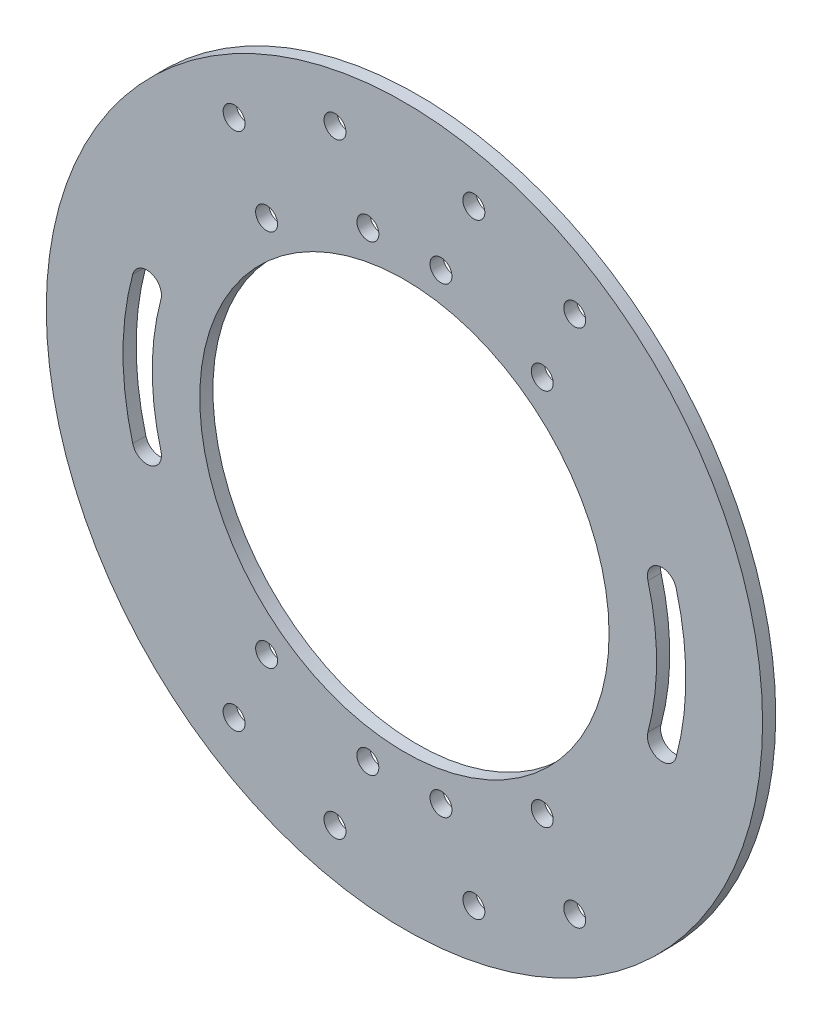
ISO-10303-21;
HEADER;
FILE_DESCRIPTION(('STEP AP214'),'2;1');
FILE_NAME('part.step','',(''),(''),'','','');
FILE_SCHEMA(('AUTOMOTIVE_DESIGN { 1 0 10303 214 1 1 1 1 }'));
ENDSEC;
DATA;
#1=APPLICATION_CONTEXT('core data for automotive mechanical design processes');
#2=APPLICATION_PROTOCOL_DEFINITION('international standard','automotive_design',2000,#1);
#3=PRODUCT_CONTEXT('',#1,'mechanical');
#4=PRODUCT('Part','Part','',(#3));
#5=PRODUCT_RELATED_PRODUCT_CATEGORY('part','',(#4));
#6=PRODUCT_DEFINITION_FORMATION('','',#4);
#7=PRODUCT_DEFINITION_CONTEXT('part definition',#1,'design');
#8=PRODUCT_DEFINITION('design','',#6,#7);
#9=PRODUCT_DEFINITION_SHAPE('','',#8);
#10=(LENGTH_UNIT() NAMED_UNIT(*) SI_UNIT(.MILLI.,.METRE.));
#11=(NAMED_UNIT(*) PLANE_ANGLE_UNIT() SI_UNIT($,.RADIAN.));
#12=(NAMED_UNIT(*) SI_UNIT($,.STERADIAN.) SOLID_ANGLE_UNIT());
#13=UNCERTAINTY_MEASURE_WITH_UNIT(LENGTH_MEASURE(1.E-05),#10,'distance_accuracy_value','');
#14=(GEOMETRIC_REPRESENTATION_CONTEXT(3) GLOBAL_UNCERTAINTY_ASSIGNED_CONTEXT((#13)) GLOBAL_UNIT_ASSIGNED_CONTEXT((#10,
#11,#12)) REPRESENTATION_CONTEXT('',''));
#15=CARTESIAN_POINT('',(0.,0.,0.));
#16=DIRECTION('',(0.,0.,1.));
#17=DIRECTION('',(1.,0.,0.));
#18=AXIS2_PLACEMENT_3D('',#15,#16,#17);
#19=CARTESIAN_POINT('',(0.,0.,1.8));
#20=DIRECTION('',(0.,0.,1.));
#21=DIRECTION('',(1.,0.,0.));
#22=AXIS2_PLACEMENT_3D('',#19,#20,#21);
#23=PLANE('',#22);
#24=CARTESIAN_POINT('',(35.2420203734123,9.49999999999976,1.8));
#25=DIRECTION('',(0.,0.,1.));
#26=DIRECTION('',(-1.,0.,0.));
#27=AXIS2_PLACEMENT_3D('',#24,#25,#26);
#28=CIRCLE('',#27,2.);
#29=CARTESIAN_POINT('',(37.1730899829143,10.0205479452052,1.8));
#30=VERTEX_POINT('',#29);
#31=CARTESIAN_POINT('',(33.3109507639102,8.97945205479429,1.8));
#32=VERTEX_POINT('',#31);
#33=EDGE_CURVE('E368',#30,#32,#28,.T.);
#34=ORIENTED_EDGE('',*,*,#33,.F.);
#35=CARTESIAN_POINT('',(0.,0.,1.8));
#36=DIRECTION('',(0.,0.,1.));
#37=DIRECTION('',(-1.,0.,0.));
#38=AXIS2_PLACEMENT_3D('',#35,#36,#37);
#39=CIRCLE('',#38,38.5);
#40=CARTESIAN_POINT('',(37.1730899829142,-10.0205479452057,1.8));
#41=VERTEX_POINT('',#40);
#42=EDGE_CURVE('E435',#41,#30,#39,.T.);
#43=ORIENTED_EDGE('',*,*,#42,.F.);
#44=CARTESIAN_POINT('',(35.2420203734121,-9.50000000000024,1.8));
#45=DIRECTION('',(0.,0.,1.));
#46=DIRECTION('',(-1.,0.,0.));
#47=AXIS2_PLACEMENT_3D('',#44,#45,#46);
#48=CIRCLE('',#47,2.);
#49=CARTESIAN_POINT('',(33.3109507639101,-8.97945205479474,1.8));
#50=VERTEX_POINT('',#49);
#51=EDGE_CURVE('E420',#50,#41,#48,.T.);
#52=ORIENTED_EDGE('',*,*,#51,.F.);
#53=CARTESIAN_POINT('',(0.,0.,1.8));
#54=DIRECTION('',(0.,0.,-1.));
#55=DIRECTION('',(-1.,0.,0.));
#56=AXIS2_PLACEMENT_3D('',#53,#54,#55);
#57=CIRCLE('',#56,34.5);
#58=EDGE_CURVE('E429',#32,#50,#57,.T.);
#59=ORIENTED_EDGE('',*,*,#58,.F.);
#60=EDGE_LOOP('',(#34,#43,#52,#59));
#61=FACE_BOUND('',#60,.T.);
#62=CARTESIAN_POINT('',(-35.2420203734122,-9.5,1.8));
#63=DIRECTION('',(0.,0.,1.));
#64=DIRECTION('',(1.,0.,0.));
#65=AXIS2_PLACEMENT_3D('',#62,#63,#64);
#66=CIRCLE('',#65,2.);
#67=CARTESIAN_POINT('',(-37.1730899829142,-10.0205479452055,1.8));
#68=VERTEX_POINT('',#67);
#69=CARTESIAN_POINT('',(-33.3109507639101,-8.97945205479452,1.8));
#70=VERTEX_POINT('',#69);
#71=EDGE_CURVE('E451',#68,#70,#66,.T.);
#72=ORIENTED_EDGE('',*,*,#71,.F.);
#73=CARTESIAN_POINT('',(0.,0.,1.8));
#74=DIRECTION('',(0.,0.,1.));
#75=DIRECTION('',(1.,0.,0.));
#76=AXIS2_PLACEMENT_3D('',#73,#74,#75);
#77=CIRCLE('',#76,38.5);
#78=CARTESIAN_POINT('',(-37.1730899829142,10.0205479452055,1.8));
#79=VERTEX_POINT('',#78);
#80=EDGE_CURVE('E461',#79,#68,#77,.T.);
#81=ORIENTED_EDGE('',*,*,#80,.F.);
#82=CARTESIAN_POINT('',(-35.2420203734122,9.5,1.8));
#83=DIRECTION('',(0.,0.,1.));
#84=DIRECTION('',(1.,0.,0.));
#85=AXIS2_PLACEMENT_3D('',#82,#83,#84);
#86=CIRCLE('',#85,2.);
#87=CARTESIAN_POINT('',(-33.3109507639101,8.97945205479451,1.8));
#88=VERTEX_POINT('',#87);
#89=EDGE_CURVE('E458',#88,#79,#86,.T.);
#90=ORIENTED_EDGE('',*,*,#89,.F.);
#91=CARTESIAN_POINT('',(0.,0.,1.8));
#92=DIRECTION('',(0.,0.,-1.));
#93=DIRECTION('',(1.,0.,0.));
#94=AXIS2_PLACEMENT_3D('',#91,#92,#93);
#95=CIRCLE('',#94,34.5);
#96=EDGE_CURVE('E455',#70,#88,#95,.T.);
#97=ORIENTED_EDGE('',*,*,#96,.F.);
#98=EDGE_LOOP('',(#72,#81,#90,#97));
#99=FACE_BOUND('',#98,.T.);
#100=CARTESIAN_POINT('',(-18.8537723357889,-25.8560489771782,1.8));
#101=DIRECTION('',(0.,0.,1.));
#102=DIRECTION('',(-1.,0.,0.));
#103=AXIS2_PLACEMENT_3D('',#100,#101,#102);
#104=CIRCLE('',#103,1.5);
#105=CARTESIAN_POINT('',(-20.3537723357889,-25.8560489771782,1.8));
#106=VERTEX_POINT('',#105);
#107=EDGE_CURVE('E494',#106,#106,#104,.T.);
#108=ORIENTED_EDGE('',*,*,#107,.F.);
#109=EDGE_LOOP('',(#108));
#110=FACE_BOUND('',#109,.T.);
#111=CARTESIAN_POINT('',(-23.2993075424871,-35.5442297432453,1.8));
#112=DIRECTION('',(0.,0.,1.));
#113=DIRECTION('',(-1.,0.,0.));
#114=AXIS2_PLACEMENT_3D('',#111,#112,#113);
#115=CIRCLE('',#114,1.5);
#116=CARTESIAN_POINT('',(-24.7993075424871,-35.5442297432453,1.8));
#117=VERTEX_POINT('',#116);
#118=EDGE_CURVE('E506',#117,#117,#115,.T.);
#119=ORIENTED_EDGE('',*,*,#118,.F.);
#120=EDGE_LOOP('',(#119));
#121=FACE_BOUND('',#120,.T.);
#122=CARTESIAN_POINT('',(9.50000000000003,-41.4246303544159,1.8));
#123=DIRECTION('',(0.,0.,1.));
#124=DIRECTION('',(1.,0.,0.));
#125=AXIS2_PLACEMENT_3D('',#122,#123,#124);
#126=CIRCLE('',#125,1.5);
#127=CARTESIAN_POINT('',(11.,-41.4246303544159,1.8));
#128=VERTEX_POINT('',#127);
#129=EDGE_CURVE('E518',#128,#128,#126,.T.);
#130=ORIENTED_EDGE('',*,*,#129,.F.);
#131=EDGE_LOOP('',(#130));
#132=FACE_BOUND('',#131,.T.);
#133=CARTESIAN_POINT('',(5.00000000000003,-31.6069612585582,1.8));
#134=DIRECTION('',(0.,0.,1.));
#135=DIRECTION('',(1.,0.,0.));
#136=AXIS2_PLACEMENT_3D('',#133,#134,#135);
#137=CIRCLE('',#136,1.49999999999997);
#138=CARTESIAN_POINT('',(6.50000000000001,-31.6069612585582,1.8));
#139=VERTEX_POINT('',#138);
#140=EDGE_CURVE('E530',#139,#139,#137,.T.);
#141=ORIENTED_EDGE('',*,*,#140,.F.);
#142=EDGE_LOOP('',(#141));
#143=FACE_BOUND('',#142,.T.);
#144=CARTESIAN_POINT('',(18.853772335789,25.8560489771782,1.8));
#145=DIRECTION('',(0.,0.,1.));
#146=DIRECTION('',(-1.,0.,0.));
#147=AXIS2_PLACEMENT_3D('',#144,#145,#146);
#148=CIRCLE('',#147,1.5);
#149=CARTESIAN_POINT('',(17.353772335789,25.8560489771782,1.8));
#150=VERTEX_POINT('',#149);
#151=EDGE_CURVE('E542',#150,#150,#148,.T.);
#152=ORIENTED_EDGE('',*,*,#151,.F.);
#153=EDGE_LOOP('',(#152));
#154=FACE_BOUND('',#153,.T.);
#155=CARTESIAN_POINT('',(23.2993075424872,35.5442297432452,1.8));
#156=DIRECTION('',(0.,0.,1.));
#157=DIRECTION('',(-1.,0.,0.));
#158=AXIS2_PLACEMENT_3D('',#155,#156,#157);
#159=CIRCLE('',#158,1.5);
#160=CARTESIAN_POINT('',(21.7993075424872,35.5442297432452,1.8));
#161=VERTEX_POINT('',#160);
#162=EDGE_CURVE('E554',#161,#161,#159,.T.);
#163=ORIENTED_EDGE('',*,*,#162,.F.);
#164=EDGE_LOOP('',(#163));
#165=FACE_BOUND('',#164,.T.);
#166=CARTESIAN_POINT('',(-9.50000000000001,41.424630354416,1.8));
#167=DIRECTION('',(0.,0.,1.));
#168=DIRECTION('',(1.,0.,0.));
#169=AXIS2_PLACEMENT_3D('',#166,#167,#168);
#170=CIRCLE('',#169,1.5);
#171=CARTESIAN_POINT('',(-8.,41.424630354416,1.8));
#172=VERTEX_POINT('',#171);
#173=EDGE_CURVE('E566',#172,#172,#170,.T.);
#174=ORIENTED_EDGE('',*,*,#173,.F.);
#175=EDGE_LOOP('',(#174));
#176=FACE_BOUND('',#175,.T.);
#177=CARTESIAN_POINT('',(-5.,31.6069612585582,1.8));
#178=DIRECTION('',(0.,0.,1.));
#179=DIRECTION('',(1.,0.,0.));
#180=AXIS2_PLACEMENT_3D('',#177,#178,#179);
#181=CIRCLE('',#180,1.5);
#182=CARTESIAN_POINT('',(-3.5,31.6069612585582,1.8));
#183=VERTEX_POINT('',#182);
#184=EDGE_CURVE('E578',#183,#183,#181,.T.);
#185=ORIENTED_EDGE('',*,*,#184,.F.);
#186=EDGE_LOOP('',(#185));
#187=FACE_BOUND('',#186,.T.);
#188=CARTESIAN_POINT('',(0.,0.,1.8));
#189=DIRECTION('',(0.,0.,1.));
#190=DIRECTION('',(1.,0.,0.));
#191=AXIS2_PLACEMENT_3D('',#188,#189,#190);
#192=CIRCLE('',#191,49.);
#193=CARTESIAN_POINT('',(49.,0.,1.8));
#194=VERTEX_POINT('',#193);
#195=EDGE_CURVE('E11',#194,#194,#192,.T.);
#196=ORIENTED_EDGE('',*,*,#195,.T.);
#197=EDGE_LOOP('',(#196));
#198=FACE_BOUND('',#197,.T.);
#199=CARTESIAN_POINT('',(0.,0.,1.8));
#200=DIRECTION('',(0.,0.,1.));
#201=DIRECTION('',(1.,0.,0.));
#202=AXIS2_PLACEMENT_3D('',#199,#200,#201);
#203=CIRCLE('',#202,28.);
#204=CARTESIAN_POINT('',(28.,0.,1.8));
#205=VERTEX_POINT('',#204);
#206=EDGE_CURVE('E584',#205,#205,#203,.T.);
#207=ORIENTED_EDGE('',*,*,#206,.F.);
#208=EDGE_LOOP('',(#207));
#209=FACE_BOUND('',#208,.T.);
#210=CARTESIAN_POINT('',(-18.853772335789,25.8560489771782,1.8));
#211=DIRECTION('',(0.,0.,1.));
#212=DIRECTION('',(1.,0.,0.));
#213=AXIS2_PLACEMENT_3D('',#210,#211,#212);
#214=CIRCLE('',#213,1.5);
#215=CARTESIAN_POINT('',(-17.353772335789,25.8560489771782,1.8));
#216=VERTEX_POINT('',#215);
#217=EDGE_CURVE('E572',#216,#216,#214,.T.);
#218=ORIENTED_EDGE('',*,*,#217,.F.);
#219=EDGE_LOOP('',(#218));
#220=FACE_BOUND('',#219,.T.);
#221=CARTESIAN_POINT('',(-23.2993075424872,35.5442297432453,1.8));
#222=DIRECTION('',(0.,0.,1.));
#223=DIRECTION('',(1.,0.,0.));
#224=AXIS2_PLACEMENT_3D('',#221,#222,#223);
#225=CIRCLE('',#224,1.5);
#226=CARTESIAN_POINT('',(-21.7993075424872,35.5442297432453,1.8));
#227=VERTEX_POINT('',#226);
#228=EDGE_CURVE('E560',#227,#227,#225,.T.);
#229=ORIENTED_EDGE('',*,*,#228,.F.);
#230=EDGE_LOOP('',(#229));
#231=FACE_BOUND('',#230,.T.);
#232=CARTESIAN_POINT('',(9.50000000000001,41.4246303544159,1.8));
#233=DIRECTION('',(0.,0.,1.));
#234=DIRECTION('',(-1.,0.,0.));
#235=AXIS2_PLACEMENT_3D('',#232,#233,#234);
#236=CIRCLE('',#235,1.5);
#237=CARTESIAN_POINT('',(8.,41.4246303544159,1.8));
#238=VERTEX_POINT('',#237);
#239=EDGE_CURVE('E548',#238,#238,#236,.T.);
#240=ORIENTED_EDGE('',*,*,#239,.F.);
#241=EDGE_LOOP('',(#240));
#242=FACE_BOUND('',#241,.T.);
#243=CARTESIAN_POINT('',(5.,31.6069612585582,1.8));
#244=DIRECTION('',(0.,0.,1.));
#245=DIRECTION('',(-1.,0.,0.));
#246=AXIS2_PLACEMENT_3D('',#243,#244,#245);
#247=CIRCLE('',#246,1.5);
#248=CARTESIAN_POINT('',(3.5,31.6069612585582,1.8));
#249=VERTEX_POINT('',#248);
#250=EDGE_CURVE('E536',#249,#249,#247,.T.);
#251=ORIENTED_EDGE('',*,*,#250,.F.);
#252=EDGE_LOOP('',(#251));
#253=FACE_BOUND('',#252,.T.);
#254=CARTESIAN_POINT('',(18.853772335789,-25.8560489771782,1.8));
#255=DIRECTION('',(0.,0.,1.));
#256=DIRECTION('',(1.,0.,0.));
#257=AXIS2_PLACEMENT_3D('',#254,#255,#256);
#258=CIRCLE('',#257,1.5);
#259=CARTESIAN_POINT('',(20.353772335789,-25.8560489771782,1.8));
#260=VERTEX_POINT('',#259);
#261=EDGE_CURVE('E524',#260,#260,#258,.T.);
#262=ORIENTED_EDGE('',*,*,#261,.F.);
#263=EDGE_LOOP('',(#262));
#264=FACE_BOUND('',#263,.T.);
#265=CARTESIAN_POINT('',(23.2993075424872,-35.5442297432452,1.8));
#266=DIRECTION('',(0.,0.,1.));
#267=DIRECTION('',(1.,0.,0.));
#268=AXIS2_PLACEMENT_3D('',#265,#266,#267);
#269=CIRCLE('',#268,1.5);
#270=CARTESIAN_POINT('',(24.7993075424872,-35.5442297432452,1.8));
#271=VERTEX_POINT('',#270);
#272=EDGE_CURVE('E512',#271,#271,#269,.T.);
#273=ORIENTED_EDGE('',*,*,#272,.F.);
#274=EDGE_LOOP('',(#273));
#275=FACE_BOUND('',#274,.T.);
#276=CARTESIAN_POINT('',(-9.49999999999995,-41.424630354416,1.8));
#277=DIRECTION('',(0.,0.,1.));
#278=DIRECTION('',(-1.,0.,0.));
#279=AXIS2_PLACEMENT_3D('',#276,#277,#278);
#280=CIRCLE('',#279,1.5);
#281=CARTESIAN_POINT('',(-11.,-41.424630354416,1.8));
#282=VERTEX_POINT('',#281);
#283=EDGE_CURVE('E500',#282,#282,#280,.T.);
#284=ORIENTED_EDGE('',*,*,#283,.F.);
#285=EDGE_LOOP('',(#284));
#286=FACE_BOUND('',#285,.T.);
#287=CARTESIAN_POINT('',(-4.99999999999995,-31.6069612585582,1.8));
#288=DIRECTION('',(0.,0.,1.));
#289=DIRECTION('',(-1.,0.,0.));
#290=AXIS2_PLACEMENT_3D('',#287,#288,#289);
#291=CIRCLE('',#290,1.5);
#292=CARTESIAN_POINT('',(-6.49999999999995,-31.6069612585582,1.8));
#293=VERTEX_POINT('',#292);
#294=EDGE_CURVE('E488',#293,#293,#291,.T.);
#295=ORIENTED_EDGE('',*,*,#294,.F.);
#296=EDGE_LOOP('',(#295));
#297=FACE_BOUND('',#296,.T.);
#298=ADVANCED_FACE('F353',(#61,#99,#110,#121,#132,#143,#154,#165,#176,#187,#198,#209,#220,#231,
#242,#253,#264,#275,#286,#297),#23,.T.);
#299=CARTESIAN_POINT('',(0.,0.,0.));
#300=DIRECTION('',(0.,0.,1.));
#301=DIRECTION('',(1.,0.,0.));
#302=AXIS2_PLACEMENT_3D('',#299,#300,#301);
#303=PLANE('',#302);
#304=CARTESIAN_POINT('',(0.,0.,0.));
#305=DIRECTION('',(0.,0.,1.));
#306=DIRECTION('',(-1.,0.,0.));
#307=AXIS2_PLACEMENT_3D('',#304,#305,#306);
#308=CIRCLE('',#307,38.5);
#309=CARTESIAN_POINT('',(37.1730899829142,-10.0205479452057,0.));
#310=VERTEX_POINT('',#309);
#311=CARTESIAN_POINT('',(37.1730899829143,10.0205479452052,0.));
#312=VERTEX_POINT('',#311);
#313=EDGE_CURVE('E446',#310,#312,#308,.T.);
#314=ORIENTED_EDGE('',*,*,#313,.T.);
#315=CARTESIAN_POINT('',(35.2420203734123,9.49999999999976,0.));
#316=DIRECTION('',(0.,0.,1.));
#317=DIRECTION('',(-1.,0.,0.));
#318=AXIS2_PLACEMENT_3D('',#315,#316,#317);
#319=CIRCLE('',#318,2.);
#320=CARTESIAN_POINT('',(33.3109507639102,8.97945205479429,0.));
#321=VERTEX_POINT('',#320);
#322=EDGE_CURVE('E437',#312,#321,#319,.T.);
#323=ORIENTED_EDGE('',*,*,#322,.T.);
#324=CARTESIAN_POINT('',(0.,0.,0.));
#325=DIRECTION('',(0.,0.,-1.));
#326=DIRECTION('',(-1.,0.,0.));
#327=AXIS2_PLACEMENT_3D('',#324,#325,#326);
#328=CIRCLE('',#327,34.5);
#329=CARTESIAN_POINT('',(33.3109507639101,-8.97945205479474,0.));
#330=VERTEX_POINT('',#329);
#331=EDGE_CURVE('E443',#321,#330,#328,.T.);
#332=ORIENTED_EDGE('',*,*,#331,.T.);
#333=CARTESIAN_POINT('',(35.2420203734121,-9.50000000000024,0.));
#334=DIRECTION('',(0.,0.,1.));
#335=DIRECTION('',(-1.,0.,0.));
#336=AXIS2_PLACEMENT_3D('',#333,#334,#335);
#337=CIRCLE('',#336,2.);
#338=EDGE_CURVE('E376',#330,#310,#337,.T.);
#339=ORIENTED_EDGE('',*,*,#338,.T.);
#340=EDGE_LOOP('',(#314,#323,#332,#339));
#341=FACE_BOUND('',#340,.T.);
#342=CARTESIAN_POINT('',(0.,0.,0.));
#343=DIRECTION('',(0.,0.,1.));
#344=DIRECTION('',(1.,0.,0.));
#345=AXIS2_PLACEMENT_3D('',#342,#343,#344);
#346=CIRCLE('',#345,38.5);
#347=CARTESIAN_POINT('',(-37.1730899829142,10.0205479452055,0.));
#348=VERTEX_POINT('',#347);
#349=CARTESIAN_POINT('',(-37.1730899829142,-10.0205479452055,0.));
#350=VERTEX_POINT('',#349);
#351=EDGE_CURVE('E473',#348,#350,#346,.T.);
#352=ORIENTED_EDGE('',*,*,#351,.T.);
#353=CARTESIAN_POINT('',(-35.2420203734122,-9.5,0.));
#354=DIRECTION('',(0.,0.,1.));
#355=DIRECTION('',(1.,0.,0.));
#356=AXIS2_PLACEMENT_3D('',#353,#354,#355);
#357=CIRCLE('',#356,2.);
#358=CARTESIAN_POINT('',(-33.3109507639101,-8.97945205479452,0.));
#359=VERTEX_POINT('',#358);
#360=EDGE_CURVE('E464',#350,#359,#357,.T.);
#361=ORIENTED_EDGE('',*,*,#360,.T.);
#362=CARTESIAN_POINT('',(0.,0.,0.));
#363=DIRECTION('',(0.,0.,-1.));
#364=DIRECTION('',(1.,0.,0.));
#365=AXIS2_PLACEMENT_3D('',#362,#363,#364);
#366=CIRCLE('',#365,34.5);
#367=CARTESIAN_POINT('',(-33.3109507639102,8.97945205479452,0.));
#368=VERTEX_POINT('',#367);
#369=EDGE_CURVE('E467',#359,#368,#366,.T.);
#370=ORIENTED_EDGE('',*,*,#369,.T.);
#371=CARTESIAN_POINT('',(-35.2420203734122,9.5,0.));
#372=DIRECTION('',(0.,0.,1.));
#373=DIRECTION('',(1.,0.,0.));
#374=AXIS2_PLACEMENT_3D('',#371,#372,#373);
#375=CIRCLE('',#374,2.);
#376=EDGE_CURVE('E470',#368,#348,#375,.T.);
#377=ORIENTED_EDGE('',*,*,#376,.T.);
#378=EDGE_LOOP('',(#352,#361,#370,#377));
#379=FACE_BOUND('',#378,.T.);
#380=CARTESIAN_POINT('',(-18.8537723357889,-25.8560489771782,0.));
#381=DIRECTION('',(0.,0.,1.));
#382=DIRECTION('',(-1.,0.,0.));
#383=AXIS2_PLACEMENT_3D('',#380,#381,#382);
#384=CIRCLE('',#383,1.5);
#385=CARTESIAN_POINT('',(-20.3537723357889,-25.8560489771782,0.));
#386=VERTEX_POINT('',#385);
#387=EDGE_CURVE('E491',#386,#386,#384,.T.);
#388=ORIENTED_EDGE('',*,*,#387,.T.);
#389=EDGE_LOOP('',(#388));
#390=FACE_BOUND('',#389,.T.);
#391=CARTESIAN_POINT('',(-23.2993075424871,-35.5442297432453,0.));
#392=DIRECTION('',(0.,0.,1.));
#393=DIRECTION('',(-1.,0.,0.));
#394=AXIS2_PLACEMENT_3D('',#391,#392,#393);
#395=CIRCLE('',#394,1.5);
#396=CARTESIAN_POINT('',(-24.7993075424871,-35.5442297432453,0.));
#397=VERTEX_POINT('',#396);
#398=EDGE_CURVE('E503',#397,#397,#395,.T.);
#399=ORIENTED_EDGE('',*,*,#398,.T.);
#400=EDGE_LOOP('',(#399));
#401=FACE_BOUND('',#400,.T.);
#402=CARTESIAN_POINT('',(9.50000000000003,-41.4246303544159,0.));
#403=DIRECTION('',(0.,0.,1.));
#404=DIRECTION('',(1.,0.,0.));
#405=AXIS2_PLACEMENT_3D('',#402,#403,#404);
#406=CIRCLE('',#405,1.5);
#407=CARTESIAN_POINT('',(11.,-41.4246303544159,0.));
#408=VERTEX_POINT('',#407);
#409=EDGE_CURVE('E515',#408,#408,#406,.T.);
#410=ORIENTED_EDGE('',*,*,#409,.T.);
#411=EDGE_LOOP('',(#410));
#412=FACE_BOUND('',#411,.T.);
#413=CARTESIAN_POINT('',(5.00000000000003,-31.6069612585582,0.));
#414=DIRECTION('',(0.,0.,1.));
#415=DIRECTION('',(1.,0.,0.));
#416=AXIS2_PLACEMENT_3D('',#413,#414,#415);
#417=CIRCLE('',#416,1.49999999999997);
#418=CARTESIAN_POINT('',(6.50000000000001,-31.6069612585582,0.));
#419=VERTEX_POINT('',#418);
#420=EDGE_CURVE('E527',#419,#419,#417,.T.);
#421=ORIENTED_EDGE('',*,*,#420,.T.);
#422=EDGE_LOOP('',(#421));
#423=FACE_BOUND('',#422,.T.);
#424=CARTESIAN_POINT('',(18.853772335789,25.8560489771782,0.));
#425=DIRECTION('',(0.,0.,1.));
#426=DIRECTION('',(-1.,0.,0.));
#427=AXIS2_PLACEMENT_3D('',#424,#425,#426);
#428=CIRCLE('',#427,1.5);
#429=CARTESIAN_POINT('',(17.353772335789,25.8560489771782,0.));
#430=VERTEX_POINT('',#429);
#431=EDGE_CURVE('E539',#430,#430,#428,.T.);
#432=ORIENTED_EDGE('',*,*,#431,.T.);
#433=EDGE_LOOP('',(#432));
#434=FACE_BOUND('',#433,.T.);
#435=CARTESIAN_POINT('',(23.2993075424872,35.5442297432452,0.));
#436=DIRECTION('',(0.,0.,1.));
#437=DIRECTION('',(-1.,0.,0.));
#438=AXIS2_PLACEMENT_3D('',#435,#436,#437);
#439=CIRCLE('',#438,1.5);
#440=CARTESIAN_POINT('',(21.7993075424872,35.5442297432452,0.));
#441=VERTEX_POINT('',#440);
#442=EDGE_CURVE('E551',#441,#441,#439,.T.);
#443=ORIENTED_EDGE('',*,*,#442,.T.);
#444=EDGE_LOOP('',(#443));
#445=FACE_BOUND('',#444,.T.);
#446=CARTESIAN_POINT('',(-9.50000000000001,41.424630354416,0.));
#447=DIRECTION('',(0.,0.,1.));
#448=DIRECTION('',(1.,0.,0.));
#449=AXIS2_PLACEMENT_3D('',#446,#447,#448);
#450=CIRCLE('',#449,1.5);
#451=CARTESIAN_POINT('',(-8.,41.424630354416,0.));
#452=VERTEX_POINT('',#451);
#453=EDGE_CURVE('E563',#452,#452,#450,.T.);
#454=ORIENTED_EDGE('',*,*,#453,.T.);
#455=EDGE_LOOP('',(#454));
#456=FACE_BOUND('',#455,.T.);
#457=CARTESIAN_POINT('',(-5.,31.6069612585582,0.));
#458=DIRECTION('',(0.,0.,1.));
#459=DIRECTION('',(1.,0.,0.));
#460=AXIS2_PLACEMENT_3D('',#457,#458,#459);
#461=CIRCLE('',#460,1.5);
#462=CARTESIAN_POINT('',(-3.5,31.6069612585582,0.));
#463=VERTEX_POINT('',#462);
#464=EDGE_CURVE('E575',#463,#463,#461,.T.);
#465=ORIENTED_EDGE('',*,*,#464,.T.);
#466=EDGE_LOOP('',(#465));
#467=FACE_BOUND('',#466,.T.);
#468=CARTESIAN_POINT('',(0.,0.,0.));
#469=DIRECTION('',(0.,0.,1.));
#470=DIRECTION('',(1.,0.,0.));
#471=AXIS2_PLACEMENT_3D('',#468,#469,#470);
#472=CIRCLE('',#471,49.);
#473=CARTESIAN_POINT('',(49.,0.,0.));
#474=VERTEX_POINT('',#473);
#475=EDGE_CURVE('E361',#474,#474,#472,.T.);
#476=ORIENTED_EDGE('',*,*,#475,.F.);
#477=EDGE_LOOP('',(#476));
#478=FACE_BOUND('',#477,.T.);
#479=CARTESIAN_POINT('',(0.,0.,0.));
#480=DIRECTION('',(0.,0.,1.));
#481=DIRECTION('',(1.,0.,0.));
#482=AXIS2_PLACEMENT_3D('',#479,#480,#481);
#483=CIRCLE('',#482,28.);
#484=CARTESIAN_POINT('',(28.,0.,0.));
#485=VERTEX_POINT('',#484);
#486=EDGE_CURVE('E581',#485,#485,#483,.T.);
#487=ORIENTED_EDGE('',*,*,#486,.T.);
#488=EDGE_LOOP('',(#487));
#489=FACE_BOUND('',#488,.T.);
#490=CARTESIAN_POINT('',(-18.853772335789,25.8560489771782,0.));
#491=DIRECTION('',(0.,0.,1.));
#492=DIRECTION('',(1.,0.,0.));
#493=AXIS2_PLACEMENT_3D('',#490,#491,#492);
#494=CIRCLE('',#493,1.5);
#495=CARTESIAN_POINT('',(-17.353772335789,25.8560489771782,0.));
#496=VERTEX_POINT('',#495);
#497=EDGE_CURVE('E569',#496,#496,#494,.T.);
#498=ORIENTED_EDGE('',*,*,#497,.T.);
#499=EDGE_LOOP('',(#498));
#500=FACE_BOUND('',#499,.T.);
#501=CARTESIAN_POINT('',(-23.2993075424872,35.5442297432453,0.));
#502=DIRECTION('',(0.,0.,1.));
#503=DIRECTION('',(1.,0.,0.));
#504=AXIS2_PLACEMENT_3D('',#501,#502,#503);
#505=CIRCLE('',#504,1.5);
#506=CARTESIAN_POINT('',(-21.7993075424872,35.5442297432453,0.));
#507=VERTEX_POINT('',#506);
#508=EDGE_CURVE('E557',#507,#507,#505,.T.);
#509=ORIENTED_EDGE('',*,*,#508,.T.);
#510=EDGE_LOOP('',(#509));
#511=FACE_BOUND('',#510,.T.);
#512=CARTESIAN_POINT('',(9.50000000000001,41.4246303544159,0.));
#513=DIRECTION('',(0.,0.,1.));
#514=DIRECTION('',(-1.,0.,0.));
#515=AXIS2_PLACEMENT_3D('',#512,#513,#514);
#516=CIRCLE('',#515,1.5);
#517=CARTESIAN_POINT('',(8.,41.4246303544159,0.));
#518=VERTEX_POINT('',#517);
#519=EDGE_CURVE('E545',#518,#518,#516,.T.);
#520=ORIENTED_EDGE('',*,*,#519,.T.);
#521=EDGE_LOOP('',(#520));
#522=FACE_BOUND('',#521,.T.);
#523=CARTESIAN_POINT('',(5.,31.6069612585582,0.));
#524=DIRECTION('',(0.,0.,1.));
#525=DIRECTION('',(-1.,0.,0.));
#526=AXIS2_PLACEMENT_3D('',#523,#524,#525);
#527=CIRCLE('',#526,1.5);
#528=CARTESIAN_POINT('',(3.5,31.6069612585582,0.));
#529=VERTEX_POINT('',#528);
#530=EDGE_CURVE('E533',#529,#529,#527,.T.);
#531=ORIENTED_EDGE('',*,*,#530,.T.);
#532=EDGE_LOOP('',(#531));
#533=FACE_BOUND('',#532,.T.);
#534=CARTESIAN_POINT('',(18.853772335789,-25.8560489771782,0.));
#535=DIRECTION('',(0.,0.,1.));
#536=DIRECTION('',(1.,0.,0.));
#537=AXIS2_PLACEMENT_3D('',#534,#535,#536);
#538=CIRCLE('',#537,1.5);
#539=CARTESIAN_POINT('',(20.353772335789,-25.8560489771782,0.));
#540=VERTEX_POINT('',#539);
#541=EDGE_CURVE('E521',#540,#540,#538,.T.);
#542=ORIENTED_EDGE('',*,*,#541,.T.);
#543=EDGE_LOOP('',(#542));
#544=FACE_BOUND('',#543,.T.);
#545=CARTESIAN_POINT('',(23.2993075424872,-35.5442297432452,0.));
#546=DIRECTION('',(0.,0.,1.));
#547=DIRECTION('',(1.,0.,0.));
#548=AXIS2_PLACEMENT_3D('',#545,#546,#547);
#549=CIRCLE('',#548,1.5);
#550=CARTESIAN_POINT('',(24.7993075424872,-35.5442297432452,0.));
#551=VERTEX_POINT('',#550);
#552=EDGE_CURVE('E509',#551,#551,#549,.T.);
#553=ORIENTED_EDGE('',*,*,#552,.T.);
#554=EDGE_LOOP('',(#553));
#555=FACE_BOUND('',#554,.T.);
#556=CARTESIAN_POINT('',(-9.49999999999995,-41.424630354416,0.));
#557=DIRECTION('',(0.,0.,1.));
#558=DIRECTION('',(-1.,0.,0.));
#559=AXIS2_PLACEMENT_3D('',#556,#557,#558);
#560=CIRCLE('',#559,1.5);
#561=CARTESIAN_POINT('',(-11.,-41.424630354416,0.));
#562=VERTEX_POINT('',#561);
#563=EDGE_CURVE('E497',#562,#562,#560,.T.);
#564=ORIENTED_EDGE('',*,*,#563,.T.);
#565=EDGE_LOOP('',(#564));
#566=FACE_BOUND('',#565,.T.);
#567=CARTESIAN_POINT('',(-4.99999999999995,-31.6069612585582,0.));
#568=DIRECTION('',(0.,0.,1.));
#569=DIRECTION('',(-1.,0.,0.));
#570=AXIS2_PLACEMENT_3D('',#567,#568,#569);
#571=CIRCLE('',#570,1.5);
#572=CARTESIAN_POINT('',(-6.49999999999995,-31.6069612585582,0.));
#573=VERTEX_POINT('',#572);
#574=EDGE_CURVE('E479',#573,#573,#571,.T.);
#575=ORIENTED_EDGE('',*,*,#574,.T.);
#576=EDGE_LOOP('',(#575));
#577=FACE_BOUND('',#576,.T.);
#578=ADVANCED_FACE('F590',(#341,#379,#390,#401,#412,#423,#434,#445,#456,#467,#478,#489,#500,
#511,#522,#533,#544,#555,#566,#577),#303,.F.);
#579=CARTESIAN_POINT('',(0.,0.,1.8));
#580=DIRECTION('',(0.,0.,-1.));
#581=DIRECTION('',(-1.,0.,0.));
#582=AXIS2_PLACEMENT_3D('',#579,#580,#581);
#583=CYLINDRICAL_SURFACE('',#582,49.);
#584=ORIENTED_EDGE('',*,*,#195,.F.);
#585=EDGE_LOOP('',(#584));
#586=FACE_BOUND('',#585,.T.);
#587=ORIENTED_EDGE('',*,*,#475,.T.);
#588=EDGE_LOOP('',(#587));
#589=FACE_BOUND('',#588,.T.);
#590=ADVANCED_FACE('F355',(#586,#589),#583,.T.);
#591=CARTESIAN_POINT('',(0.,0.,1.8));
#592=DIRECTION('',(0.,0.,-1.));
#593=DIRECTION('',(-1.,0.,0.));
#594=AXIS2_PLACEMENT_3D('',#591,#592,#593);
#595=CYLINDRICAL_SURFACE('',#594,28.);
#596=ORIENTED_EDGE('',*,*,#206,.T.);
#597=EDGE_LOOP('',(#596));
#598=FACE_BOUND('',#597,.T.);
#599=ORIENTED_EDGE('',*,*,#486,.F.);
#600=EDGE_LOOP('',(#599));
#601=FACE_BOUND('',#600,.T.);
#602=ADVANCED_FACE('F634',(#598,#601),#595,.F.);
#603=CARTESIAN_POINT('',(-5.,31.6069612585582,1.8));
#604=DIRECTION('',(0.,0.,-1.));
#605=DIRECTION('',(-1.,0.,0.));
#606=AXIS2_PLACEMENT_3D('',#603,#604,#605);
#607=CYLINDRICAL_SURFACE('',#606,1.5);
#608=ORIENTED_EDGE('',*,*,#184,.T.);
#609=EDGE_LOOP('',(#608));
#610=FACE_BOUND('',#609,.T.);
#611=ORIENTED_EDGE('',*,*,#464,.F.);
#612=EDGE_LOOP('',(#611));
#613=FACE_BOUND('',#612,.T.);
#614=ADVANCED_FACE('F637',(#610,#613),#607,.F.);
#615=CARTESIAN_POINT('',(-18.853772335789,25.8560489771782,1.8));
#616=DIRECTION('',(0.,0.,-1.));
#617=DIRECTION('',(-1.,0.,0.));
#618=AXIS2_PLACEMENT_3D('',#615,#616,#617);
#619=CYLINDRICAL_SURFACE('',#618,1.5);
#620=ORIENTED_EDGE('',*,*,#217,.T.);
#621=EDGE_LOOP('',(#620));
#622=FACE_BOUND('',#621,.T.);
#623=ORIENTED_EDGE('',*,*,#497,.F.);
#624=EDGE_LOOP('',(#623));
#625=FACE_BOUND('',#624,.T.);
#626=ADVANCED_FACE('F641',(#622,#625),#619,.F.);
#627=CARTESIAN_POINT('',(-9.50000000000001,41.424630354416,1.8));
#628=DIRECTION('',(0.,0.,-1.));
#629=DIRECTION('',(-1.,0.,0.));
#630=AXIS2_PLACEMENT_3D('',#627,#628,#629);
#631=CYLINDRICAL_SURFACE('',#630,1.5);
#632=ORIENTED_EDGE('',*,*,#173,.T.);
#633=EDGE_LOOP('',(#632));
#634=FACE_BOUND('',#633,.T.);
#635=ORIENTED_EDGE('',*,*,#453,.F.);
#636=EDGE_LOOP('',(#635));
#637=FACE_BOUND('',#636,.T.);
#638=ADVANCED_FACE('F645',(#634,#637),#631,.F.);
#639=CARTESIAN_POINT('',(-23.2993075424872,35.5442297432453,1.8));
#640=DIRECTION('',(0.,0.,-1.));
#641=DIRECTION('',(-1.,0.,0.));
#642=AXIS2_PLACEMENT_3D('',#639,#640,#641);
#643=CYLINDRICAL_SURFACE('',#642,1.5);
#644=ORIENTED_EDGE('',*,*,#228,.T.);
#645=EDGE_LOOP('',(#644));
#646=FACE_BOUND('',#645,.T.);
#647=ORIENTED_EDGE('',*,*,#508,.F.);
#648=EDGE_LOOP('',(#647));
#649=FACE_BOUND('',#648,.T.);
#650=ADVANCED_FACE('F649',(#646,#649),#643,.F.);
#651=CARTESIAN_POINT('',(23.2993075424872,35.5442297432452,1.8));
#652=DIRECTION('',(0.,0.,-1.));
#653=DIRECTION('',(-1.,0.,0.));
#654=AXIS2_PLACEMENT_3D('',#651,#652,#653);
#655=CYLINDRICAL_SURFACE('',#654,1.5);
#656=ORIENTED_EDGE('',*,*,#162,.T.);
#657=EDGE_LOOP('',(#656));
#658=FACE_BOUND('',#657,.T.);
#659=ORIENTED_EDGE('',*,*,#442,.F.);
#660=EDGE_LOOP('',(#659));
#661=FACE_BOUND('',#660,.T.);
#662=ADVANCED_FACE('F653',(#658,#661),#655,.F.);
#663=CARTESIAN_POINT('',(9.50000000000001,41.4246303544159,1.8));
#664=DIRECTION('',(0.,0.,-1.));
#665=DIRECTION('',(-1.,0.,0.));
#666=AXIS2_PLACEMENT_3D('',#663,#664,#665);
#667=CYLINDRICAL_SURFACE('',#666,1.5);
#668=ORIENTED_EDGE('',*,*,#239,.T.);
#669=EDGE_LOOP('',(#668));
#670=FACE_BOUND('',#669,.T.);
#671=ORIENTED_EDGE('',*,*,#519,.F.);
#672=EDGE_LOOP('',(#671));
#673=FACE_BOUND('',#672,.T.);
#674=ADVANCED_FACE('F657',(#670,#673),#667,.F.);
#675=CARTESIAN_POINT('',(18.853772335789,25.8560489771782,1.8));
#676=DIRECTION('',(0.,0.,-1.));
#677=DIRECTION('',(-1.,0.,0.));
#678=AXIS2_PLACEMENT_3D('',#675,#676,#677);
#679=CYLINDRICAL_SURFACE('',#678,1.5);
#680=ORIENTED_EDGE('',*,*,#151,.T.);
#681=EDGE_LOOP('',(#680));
#682=FACE_BOUND('',#681,.T.);
#683=ORIENTED_EDGE('',*,*,#431,.F.);
#684=EDGE_LOOP('',(#683));
#685=FACE_BOUND('',#684,.T.);
#686=ADVANCED_FACE('F661',(#682,#685),#679,.F.);
#687=CARTESIAN_POINT('',(5.,31.6069612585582,1.8));
#688=DIRECTION('',(0.,0.,-1.));
#689=DIRECTION('',(-1.,0.,0.));
#690=AXIS2_PLACEMENT_3D('',#687,#688,#689);
#691=CYLINDRICAL_SURFACE('',#690,1.5);
#692=ORIENTED_EDGE('',*,*,#250,.T.);
#693=EDGE_LOOP('',(#692));
#694=FACE_BOUND('',#693,.T.);
#695=ORIENTED_EDGE('',*,*,#530,.F.);
#696=EDGE_LOOP('',(#695));
#697=FACE_BOUND('',#696,.T.);
#698=ADVANCED_FACE('F665',(#694,#697),#691,.F.);
#699=CARTESIAN_POINT('',(5.00000000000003,-31.6069612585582,1.8));
#700=DIRECTION('',(0.,0.,-1.));
#701=DIRECTION('',(-1.,0.,0.));
#702=AXIS2_PLACEMENT_3D('',#699,#700,#701);
#703=CYLINDRICAL_SURFACE('',#702,1.49999999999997);
#704=ORIENTED_EDGE('',*,*,#140,.T.);
#705=EDGE_LOOP('',(#704));
#706=FACE_BOUND('',#705,.T.);
#707=ORIENTED_EDGE('',*,*,#420,.F.);
#708=EDGE_LOOP('',(#707));
#709=FACE_BOUND('',#708,.T.);
#710=ADVANCED_FACE('F669',(#706,#709),#703,.F.);
#711=CARTESIAN_POINT('',(18.853772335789,-25.8560489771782,1.8));
#712=DIRECTION('',(0.,0.,-1.));
#713=DIRECTION('',(-1.,0.,0.));
#714=AXIS2_PLACEMENT_3D('',#711,#712,#713);
#715=CYLINDRICAL_SURFACE('',#714,1.5);
#716=ORIENTED_EDGE('',*,*,#261,.T.);
#717=EDGE_LOOP('',(#716));
#718=FACE_BOUND('',#717,.T.);
#719=ORIENTED_EDGE('',*,*,#541,.F.);
#720=EDGE_LOOP('',(#719));
#721=FACE_BOUND('',#720,.T.);
#722=ADVANCED_FACE('F673',(#718,#721),#715,.F.);
#723=CARTESIAN_POINT('',(9.50000000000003,-41.4246303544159,1.8));
#724=DIRECTION('',(0.,0.,-1.));
#725=DIRECTION('',(-1.,0.,0.));
#726=AXIS2_PLACEMENT_3D('',#723,#724,#725);
#727=CYLINDRICAL_SURFACE('',#726,1.5);
#728=ORIENTED_EDGE('',*,*,#129,.T.);
#729=EDGE_LOOP('',(#728));
#730=FACE_BOUND('',#729,.T.);
#731=ORIENTED_EDGE('',*,*,#409,.F.);
#732=EDGE_LOOP('',(#731));
#733=FACE_BOUND('',#732,.T.);
#734=ADVANCED_FACE('F677',(#730,#733),#727,.F.);
#735=CARTESIAN_POINT('',(23.2993075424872,-35.5442297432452,1.8));
#736=DIRECTION('',(0.,0.,-1.));
#737=DIRECTION('',(-1.,0.,0.));
#738=AXIS2_PLACEMENT_3D('',#735,#736,#737);
#739=CYLINDRICAL_SURFACE('',#738,1.5);
#740=ORIENTED_EDGE('',*,*,#272,.T.);
#741=EDGE_LOOP('',(#740));
#742=FACE_BOUND('',#741,.T.);
#743=ORIENTED_EDGE('',*,*,#552,.F.);
#744=EDGE_LOOP('',(#743));
#745=FACE_BOUND('',#744,.T.);
#746=ADVANCED_FACE('F681',(#742,#745),#739,.F.);
#747=CARTESIAN_POINT('',(-23.2993075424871,-35.5442297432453,1.8));
#748=DIRECTION('',(0.,0.,-1.));
#749=DIRECTION('',(-1.,0.,0.));
#750=AXIS2_PLACEMENT_3D('',#747,#748,#749);
#751=CYLINDRICAL_SURFACE('',#750,1.5);
#752=ORIENTED_EDGE('',*,*,#118,.T.);
#753=EDGE_LOOP('',(#752));
#754=FACE_BOUND('',#753,.T.);
#755=ORIENTED_EDGE('',*,*,#398,.F.);
#756=EDGE_LOOP('',(#755));
#757=FACE_BOUND('',#756,.T.);
#758=ADVANCED_FACE('F685',(#754,#757),#751,.F.);
#759=CARTESIAN_POINT('',(-9.49999999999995,-41.424630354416,1.8));
#760=DIRECTION('',(0.,0.,-1.));
#761=DIRECTION('',(-1.,0.,0.));
#762=AXIS2_PLACEMENT_3D('',#759,#760,#761);
#763=CYLINDRICAL_SURFACE('',#762,1.5);
#764=ORIENTED_EDGE('',*,*,#283,.T.);
#765=EDGE_LOOP('',(#764));
#766=FACE_BOUND('',#765,.T.);
#767=ORIENTED_EDGE('',*,*,#563,.F.);
#768=EDGE_LOOP('',(#767));
#769=FACE_BOUND('',#768,.T.);
#770=ADVANCED_FACE('F626',(#766,#769),#763,.F.);
#771=CARTESIAN_POINT('',(-18.8537723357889,-25.8560489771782,1.8));
#772=DIRECTION('',(0.,0.,-1.));
#773=DIRECTION('',(-1.,0.,0.));
#774=AXIS2_PLACEMENT_3D('',#771,#772,#773);
#775=CYLINDRICAL_SURFACE('',#774,1.5);
#776=ORIENTED_EDGE('',*,*,#107,.T.);
#777=EDGE_LOOP('',(#776));
#778=FACE_BOUND('',#777,.T.);
#779=ORIENTED_EDGE('',*,*,#387,.F.);
#780=EDGE_LOOP('',(#779));
#781=FACE_BOUND('',#780,.T.);
#782=ADVANCED_FACE('F616',(#778,#781),#775,.F.);
#783=CARTESIAN_POINT('',(-4.99999999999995,-31.6069612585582,1.8));
#784=DIRECTION('',(0.,0.,-1.));
#785=DIRECTION('',(-1.,0.,0.));
#786=AXIS2_PLACEMENT_3D('',#783,#784,#785);
#787=CYLINDRICAL_SURFACE('',#786,1.5);
#788=ORIENTED_EDGE('',*,*,#294,.T.);
#789=EDGE_LOOP('',(#788));
#790=FACE_BOUND('',#789,.T.);
#791=ORIENTED_EDGE('',*,*,#574,.F.);
#792=EDGE_LOOP('',(#791));
#793=FACE_BOUND('',#792,.T.);
#794=ADVANCED_FACE('F613',(#790,#793),#787,.F.);
#795=CARTESIAN_POINT('',(-35.2420203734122,-9.5,0.));
#796=DIRECTION('',(0.,0.,1.));
#797=DIRECTION('',(1.,0.,0.));
#798=AXIS2_PLACEMENT_3D('',#795,#796,#797);
#799=CYLINDRICAL_SURFACE('',#798,2.);
#800=ORIENTED_EDGE('',*,*,#71,.T.);
#801=DIRECTION('',(0.,0.,1.));
#802=VECTOR('',#801,1.);
#803=CARTESIAN_POINT('',(-33.3109507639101,-8.97945205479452,0.));
#804=LINE('',#803,#802);
#805=EDGE_CURVE('E476',#359,#70,#804,.T.);
#806=ORIENTED_EDGE('',*,*,#805,.F.);
#807=ORIENTED_EDGE('',*,*,#360,.F.);
#808=DIRECTION('',(0.,0.,1.));
#809=VECTOR('',#808,1.);
#810=CARTESIAN_POINT('',(-37.1730899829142,-10.0205479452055,0.));
#811=LINE('',#810,#809);
#812=EDGE_CURVE('E477',#350,#68,#811,.T.);
#813=ORIENTED_EDGE('',*,*,#812,.T.);
#814=EDGE_LOOP('',(#800,#806,#807,#813));
#815=FACE_BOUND('',#814,.T.);
#816=ADVANCED_FACE('F615',(#815),#799,.F.);
#817=CARTESIAN_POINT('',(0.,0.,0.));
#818=DIRECTION('',(0.,0.,1.));
#819=DIRECTION('',(1.,0.,0.));
#820=AXIS2_PLACEMENT_3D('',#817,#818,#819);
#821=CYLINDRICAL_SURFACE('',#820,38.5);
#822=ORIENTED_EDGE('',*,*,#80,.T.);
#823=ORIENTED_EDGE('',*,*,#812,.F.);
#824=ORIENTED_EDGE('',*,*,#351,.F.);
#825=DIRECTION('',(0.,0.,1.));
#826=VECTOR('',#825,1.);
#827=CARTESIAN_POINT('',(-37.1730899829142,10.0205479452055,0.));
#828=LINE('',#827,#826);
#829=EDGE_CURVE('E480',#348,#79,#828,.T.);
#830=ORIENTED_EDGE('',*,*,#829,.T.);
#831=EDGE_LOOP('',(#822,#823,#824,#830));
#832=FACE_BOUND('',#831,.T.);
#833=ADVANCED_FACE('F623',(#832),#821,.F.);
#834=CARTESIAN_POINT('',(-35.2420203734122,9.5,0.));
#835=DIRECTION('',(0.,0.,1.));
#836=DIRECTION('',(1.,0.,0.));
#837=AXIS2_PLACEMENT_3D('',#834,#835,#836);
#838=CYLINDRICAL_SURFACE('',#837,2.);
#839=ORIENTED_EDGE('',*,*,#89,.T.);
#840=ORIENTED_EDGE('',*,*,#829,.F.);
#841=ORIENTED_EDGE('',*,*,#376,.F.);
#842=DIRECTION('',(0.,0.,1.));
#843=VECTOR('',#842,1.);
#844=CARTESIAN_POINT('',(-33.3109507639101,8.97945205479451,0.));
#845=LINE('',#844,#843);
#846=EDGE_CURVE('E482',#368,#88,#845,.T.);
#847=ORIENTED_EDGE('',*,*,#846,.T.);
#848=EDGE_LOOP('',(#839,#840,#841,#847));
#849=FACE_BOUND('',#848,.T.);
#850=ADVANCED_FACE('F718',(#849),#838,.F.);
#851=CARTESIAN_POINT('',(0.,0.,0.));
#852=DIRECTION('',(0.,0.,1.));
#853=DIRECTION('',(1.,0.,0.));
#854=AXIS2_PLACEMENT_3D('',#851,#852,#853);
#855=CYLINDRICAL_SURFACE('',#854,34.5);
#856=ORIENTED_EDGE('',*,*,#96,.T.);
#857=ORIENTED_EDGE('',*,*,#846,.F.);
#858=ORIENTED_EDGE('',*,*,#369,.F.);
#859=ORIENTED_EDGE('',*,*,#805,.T.);
#860=EDGE_LOOP('',(#856,#857,#858,#859));
#861=FACE_BOUND('',#860,.T.);
#862=ADVANCED_FACE('F726',(#861),#855,.T.);
#863=CARTESIAN_POINT('',(35.2420203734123,9.49999999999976,0.));
#864=DIRECTION('',(0.,0.,1.));
#865=DIRECTION('',(1.,0.,0.));
#866=AXIS2_PLACEMENT_3D('',#863,#864,#865);
#867=CYLINDRICAL_SURFACE('',#866,2.);
#868=ORIENTED_EDGE('',*,*,#33,.T.);
#869=DIRECTION('',(0.,0.,1.));
#870=VECTOR('',#869,1.);
#871=CARTESIAN_POINT('',(33.3109507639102,8.97945205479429,0.));
#872=LINE('',#871,#870);
#873=EDGE_CURVE('E426',#321,#32,#872,.T.);
#874=ORIENTED_EDGE('',*,*,#873,.F.);
#875=ORIENTED_EDGE('',*,*,#322,.F.);
#876=DIRECTION('',(0.,0.,1.));
#877=VECTOR('',#876,1.);
#878=CARTESIAN_POINT('',(37.1730899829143,10.0205479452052,0.));
#879=LINE('',#878,#877);
#880=EDGE_CURVE('E449',#312,#30,#879,.T.);
#881=ORIENTED_EDGE('',*,*,#880,.T.);
#882=EDGE_LOOP('',(#868,#874,#875,#881));
#883=FACE_BOUND('',#882,.T.);
#884=ADVANCED_FACE('F733',(#883),#867,.F.);
#885=CARTESIAN_POINT('',(0.,0.,0.));
#886=DIRECTION('',(0.,0.,1.));
#887=DIRECTION('',(1.,0.,0.));
#888=AXIS2_PLACEMENT_3D('',#885,#886,#887);
#889=CYLINDRICAL_SURFACE('',#888,38.5);
#890=ORIENTED_EDGE('',*,*,#42,.T.);
#891=ORIENTED_EDGE('',*,*,#880,.F.);
#892=ORIENTED_EDGE('',*,*,#313,.F.);
#893=DIRECTION('',(0.,0.,1.));
#894=VECTOR('',#893,1.);
#895=CARTESIAN_POINT('',(37.1730899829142,-10.0205479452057,0.));
#896=LINE('',#895,#894);
#897=EDGE_CURVE('E425',#310,#41,#896,.T.);
#898=ORIENTED_EDGE('',*,*,#897,.T.);
#899=EDGE_LOOP('',(#890,#891,#892,#898));
#900=FACE_BOUND('',#899,.T.);
#901=ADVANCED_FACE('F741',(#900),#889,.F.);
#902=CARTESIAN_POINT('',(35.2420203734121,-9.50000000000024,0.));
#903=DIRECTION('',(0.,0.,1.));
#904=DIRECTION('',(1.,0.,0.));
#905=AXIS2_PLACEMENT_3D('',#902,#903,#904);
#906=CYLINDRICAL_SURFACE('',#905,2.);
#907=ORIENTED_EDGE('',*,*,#51,.T.);
#908=ORIENTED_EDGE('',*,*,#897,.F.);
#909=ORIENTED_EDGE('',*,*,#338,.F.);
#910=DIRECTION('',(0.,0.,1.));
#911=VECTOR('',#910,1.);
#912=CARTESIAN_POINT('',(33.3109507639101,-8.97945205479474,0.));
#913=LINE('',#912,#911);
#914=EDGE_CURVE('E416',#330,#50,#913,.T.);
#915=ORIENTED_EDGE('',*,*,#914,.T.);
#916=EDGE_LOOP('',(#907,#908,#909,#915));
#917=FACE_BOUND('',#916,.T.);
#918=ADVANCED_FACE('F418',(#917),#906,.F.);
#919=CARTESIAN_POINT('',(0.,0.,0.));
#920=DIRECTION('',(0.,0.,1.));
#921=DIRECTION('',(1.,0.,0.));
#922=AXIS2_PLACEMENT_3D('',#919,#920,#921);
#923=CYLINDRICAL_SURFACE('',#922,34.5);
#924=ORIENTED_EDGE('',*,*,#58,.T.);
#925=ORIENTED_EDGE('',*,*,#914,.F.);
#926=ORIENTED_EDGE('',*,*,#331,.F.);
#927=ORIENTED_EDGE('',*,*,#873,.T.);
#928=EDGE_LOOP('',(#924,#925,#926,#927));
#929=FACE_BOUND('',#928,.T.);
#930=ADVANCED_FACE('F430',(#929),#923,.T.);
#931=CLOSED_SHELL('',(#298,#578,#590,#602,#614,#626,#638,#650,#662,#674,#686,#698,#710,#722,
#734,#746,#758,#770,#782,#794,#816,#833,#850,#862,#884,#901,#918,#930));
#932=MANIFOLD_SOLID_BREP('B2',#931);
#933=ADVANCED_BREP_SHAPE_REPRESENTATION('',(#18,#932),#14);
#934=SHAPE_DEFINITION_REPRESENTATION(#9,#933);
ENDSEC;
END-ISO-10303-21;
